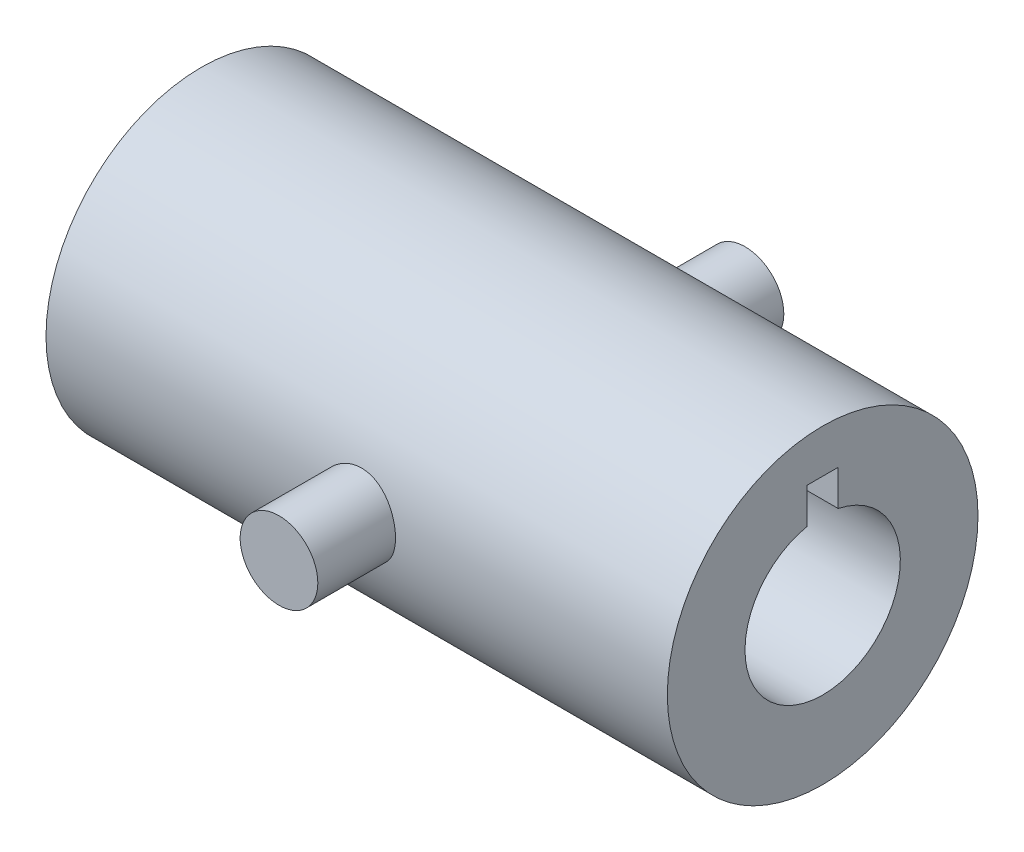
from build123d import *

# Parameters (mm, degrees)
SKETCH1_R           = 12.7
BOSS_EXTRUDE1_DEPTH = 50.8
SKETCH2_R           = 3.175
BOSS_EXTRUDE2_DEPTH = 19.05
SKETCH3_R           = 6.35
CUT_EXTRUDE1_DEPTH  = 56.721024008


with BuildPart() as part:
    # Sketch1 → Boss-Extrude1 (new body)
    with BuildSketch(Plane(origin=(0, 0, 0), x_dir=(0, 0, -1), z_dir=(1, 0, 0))):
        Circle(SKETCH1_R)
        with BuildLine():
            Line((-1.27, 6.221703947), (-1.27, 9.141703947))
            Line((-1.27, 9.141703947), (1.27, 9.141703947))
            Line((1.27, 9.141703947), (1.27, 6.221703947))
            ThreePointArc((1.27, 6.221703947), (0, -6.35), (-1.27, 6.221703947))
        make_face(mode=Mode.SUBTRACT)
    extrude(amount=BOSS_EXTRUDE1_DEPTH)

    # Sketch2 → Boss-Extrude2 (add, symmetric)
    with BuildSketch(Plane.XY):
        with Locations((25.4, 0)):
            Circle(SKETCH2_R)
    extrude(amount=BOSS_EXTRUDE2_DEPTH, both=True)

    # Sketch3 → Cut-Extrude1 (cut, through all)
    with BuildSketch(Plane(origin=(0, 0, 0), x_dir=(0, 0, -1), z_dir=(1, 0, 0))):
        Circle(SKETCH3_R)
    extrude(amount=CUT_EXTRUDE1_DEPTH, mode=Mode.SUBTRACT)


solid = part.part
